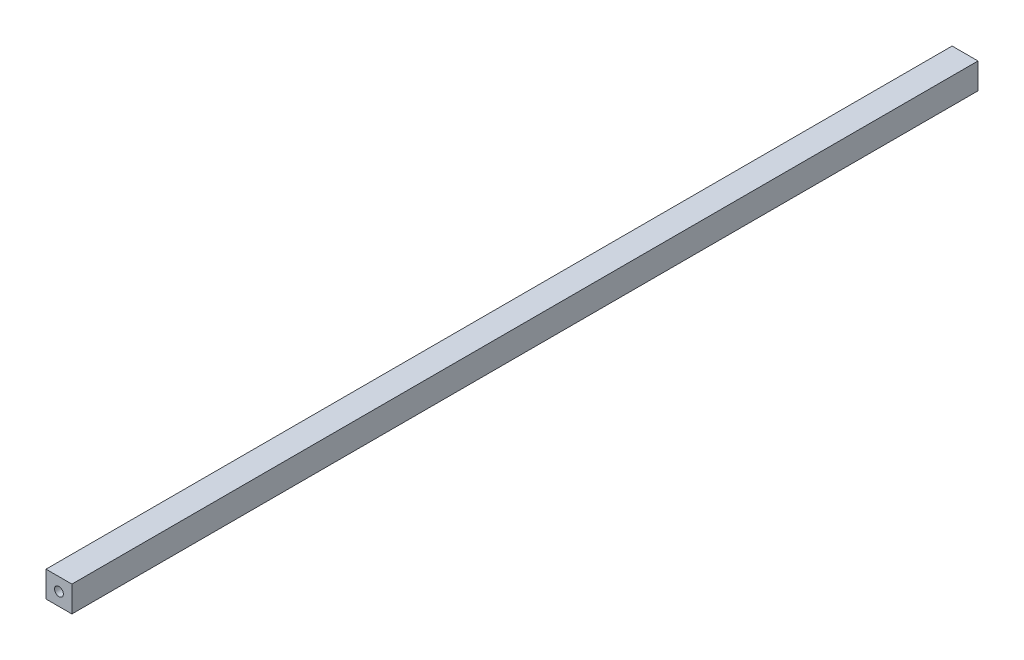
from build123d import *

# Parameters (mm, degrees)
ESQUISSE1_W                = 20
ESQUISSE1_H                = 20
EXTRUSION1_DEPTH           = 350
TROU_TARAUD_M8X1_251_D     = 6.8
TROU_TARAUD_M8X1_251_DEPTH = 20
TROU_TARAUD_M8X1_251_TIP   = 2.042926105
TROU_TARAUD_M8X1_252_D     = 6.8
TROU_TARAUD_M8X1_252_DEPTH = 20
TROU_TARAUD_M8X1_252_TIP   = 2.042926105


with BuildPart() as part:
    # Esquisse1 → Extrusion1 (new, symmetric)
    with BuildSketch(Plane.XY):
        Rectangle(ESQUISSE1_W, ESQUISSE1_H)
    extrude(amount=EXTRUSION1_DEPTH, both=True)

    # Trou taraud_ M8x1.251
    with Locations(Plane.XY.offset(350)):
        with Locations((0, 0)):
            Hole(TROU_TARAUD_M8X1_251_D / 2, depth=TROU_TARAUD_M8X1_251_DEPTH)
            with Locations((0, 0, -(TROU_TARAUD_M8X1_251_DEPTH + TROU_TARAUD_M8X1_251_TIP / 2))):  # 118° drill point
                Cone(0, TROU_TARAUD_M8X1_251_D / 2, TROU_TARAUD_M8X1_251_TIP, mode=Mode.SUBTRACT)

    # Trou taraud_ M8x1.252
    with Locations(Plane(origin=(0, 0, -350), x_dir=(-1, 0, 0), z_dir=(0, 0, -1))):
        with Locations((0, 0)):
            Hole(TROU_TARAUD_M8X1_252_D / 2, depth=TROU_TARAUD_M8X1_252_DEPTH)
            with Locations((0, 0, -(TROU_TARAUD_M8X1_252_DEPTH + TROU_TARAUD_M8X1_252_TIP / 2))):  # 118° drill point
                Cone(0, TROU_TARAUD_M8X1_252_D / 2, TROU_TARAUD_M8X1_252_TIP, mode=Mode.SUBTRACT)


solid = part.part
